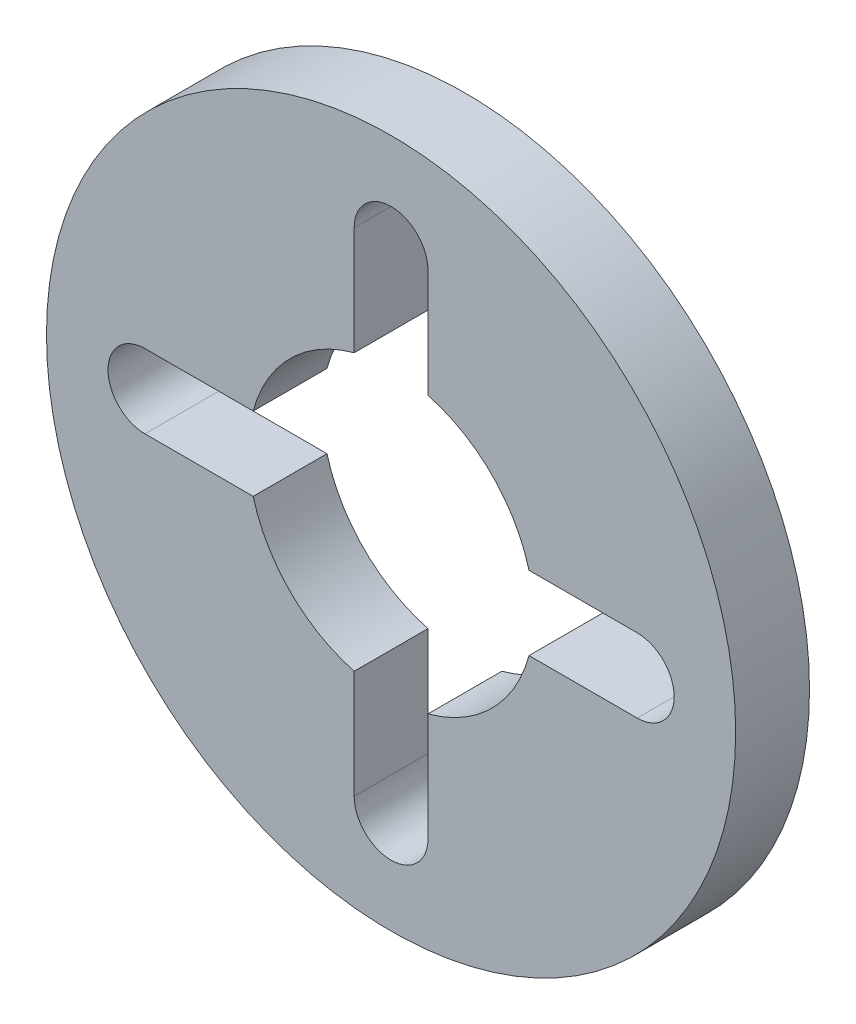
ISO-10303-21;
HEADER;
FILE_DESCRIPTION(('STEP AP214'),'2;1');
FILE_NAME('part.step','',(''),(''),'','','');
FILE_SCHEMA(('AUTOMOTIVE_DESIGN { 1 0 10303 214 1 1 1 1 }'));
ENDSEC;
DATA;
#1=APPLICATION_CONTEXT('core data for automotive mechanical design processes');
#2=APPLICATION_PROTOCOL_DEFINITION('international standard','automotive_design',2000,#1);
#3=PRODUCT_CONTEXT('',#1,'mechanical');
#4=PRODUCT('Part','Part','',(#3));
#5=PRODUCT_RELATED_PRODUCT_CATEGORY('part','',(#4));
#6=PRODUCT_DEFINITION_FORMATION('','',#4);
#7=PRODUCT_DEFINITION_CONTEXT('part definition',#1,'design');
#8=PRODUCT_DEFINITION('design','',#6,#7);
#9=PRODUCT_DEFINITION_SHAPE('','',#8);
#10=(LENGTH_UNIT() NAMED_UNIT(*) SI_UNIT(.MILLI.,.METRE.));
#11=(NAMED_UNIT(*) PLANE_ANGLE_UNIT() SI_UNIT($,.RADIAN.));
#12=(NAMED_UNIT(*) SI_UNIT($,.STERADIAN.) SOLID_ANGLE_UNIT());
#13=UNCERTAINTY_MEASURE_WITH_UNIT(LENGTH_MEASURE(1.E-05),#10,'distance_accuracy_value','');
#14=(GEOMETRIC_REPRESENTATION_CONTEXT(3) GLOBAL_UNCERTAINTY_ASSIGNED_CONTEXT((#13)) GLOBAL_UNIT_ASSIGNED_CONTEXT((#10,
#11,#12)) REPRESENTATION_CONTEXT('',''));
#15=CARTESIAN_POINT('',(0.,0.,0.));
#16=DIRECTION('',(0.,0.,1.));
#17=DIRECTION('',(1.,0.,0.));
#18=AXIS2_PLACEMENT_3D('',#15,#16,#17);
#19=CARTESIAN_POINT('',(0.,0.,1.5));
#20=DIRECTION('',(0.,0.,1.));
#21=DIRECTION('',(1.,0.,0.));
#22=AXIS2_PLACEMENT_3D('',#19,#20,#21);
#23=PLANE('',#22);
#24=CARTESIAN_POINT('',(0.,0.,1.5));
#25=DIRECTION('',(0.,0.,1.));
#26=DIRECTION('',(1.,0.,0.));
#27=AXIS2_PLACEMENT_3D('',#24,#25,#26);
#28=CIRCLE('',#27,7.);
#29=CARTESIAN_POINT('',(7.,0.,1.5));
#30=VERTEX_POINT('',#29);
#31=EDGE_CURVE('E11',#30,#30,#28,.T.);
#32=ORIENTED_EDGE('',*,*,#31,.T.);
#33=EDGE_LOOP('',(#32));
#34=FACE_BOUND('',#33,.T.);
#35=DIRECTION('',(0.,1.,0.));
#36=VECTOR('',#35,1.);
#37=CARTESIAN_POINT('',(0.75,5.,1.5));
#38=LINE('',#37,#36);
#39=CARTESIAN_POINT('',(0.750000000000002,2.80133896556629,1.5));
#40=VERTEX_POINT('',#39);
#41=CARTESIAN_POINT('',(0.750000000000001,5.,1.5));
#42=VERTEX_POINT('',#41);
#43=EDGE_CURVE('E157',#40,#42,#38,.T.);
#44=ORIENTED_EDGE('',*,*,#43,.F.);
#45=CARTESIAN_POINT('',(0.,0.,1.5));
#46=DIRECTION('',(0.,0.,1.));
#47=DIRECTION('',(1.,0.,0.));
#48=AXIS2_PLACEMENT_3D('',#45,#46,#47);
#49=CIRCLE('',#48,2.9);
#50=CARTESIAN_POINT('',(2.80133896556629,0.75,1.5));
#51=VERTEX_POINT('',#50);
#52=EDGE_CURVE('E149',#51,#40,#49,.T.);
#53=ORIENTED_EDGE('',*,*,#52,.F.);
#54=DIRECTION('',(-1.,0.,0.));
#55=VECTOR('',#54,1.);
#56=CARTESIAN_POINT('',(2.80133896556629,0.75,1.5));
#57=LINE('',#56,#55);
#58=CARTESIAN_POINT('',(5.,0.75,1.5));
#59=VERTEX_POINT('',#58);
#60=EDGE_CURVE('E197',#59,#51,#57,.T.);
#61=ORIENTED_EDGE('',*,*,#60,.F.);
#62=CARTESIAN_POINT('',(5.,0.,1.5));
#63=DIRECTION('',(0.,0.,1.));
#64=DIRECTION('',(1.,0.,0.));
#65=AXIS2_PLACEMENT_3D('',#62,#63,#64);
#66=CIRCLE('',#65,0.75);
#67=CARTESIAN_POINT('',(5.,-0.75,1.5));
#68=VERTEX_POINT('',#67);
#69=EDGE_CURVE('E195',#68,#59,#66,.T.);
#70=ORIENTED_EDGE('',*,*,#69,.F.);
#71=DIRECTION('',(1.,0.,0.));
#72=VECTOR('',#71,1.);
#73=CARTESIAN_POINT('',(2.80133896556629,-0.75,1.5));
#74=LINE('',#73,#72);
#75=CARTESIAN_POINT('',(2.80133896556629,-0.75,1.5));
#76=VERTEX_POINT('',#75);
#77=EDGE_CURVE('E193',#76,#68,#74,.T.);
#78=ORIENTED_EDGE('',*,*,#77,.F.);
#79=CARTESIAN_POINT('',(0.,0.,1.5));
#80=DIRECTION('',(0.,0.,1.));
#81=DIRECTION('',(1.,0.,0.));
#82=AXIS2_PLACEMENT_3D('',#79,#80,#81);
#83=CIRCLE('',#82,2.9);
#84=CARTESIAN_POINT('',(0.75,-2.80133896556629,1.5));
#85=VERTEX_POINT('',#84);
#86=EDGE_CURVE('E191',#85,#76,#83,.T.);
#87=ORIENTED_EDGE('',*,*,#86,.F.);
#88=DIRECTION('',(0.,1.,0.));
#89=VECTOR('',#88,1.);
#90=CARTESIAN_POINT('',(0.750000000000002,-2.80133896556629,1.5));
#91=LINE('',#90,#89);
#92=CARTESIAN_POINT('',(0.750000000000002,-5.,1.5));
#93=VERTEX_POINT('',#92);
#94=EDGE_CURVE('E189',#93,#85,#91,.T.);
#95=ORIENTED_EDGE('',*,*,#94,.F.);
#96=CARTESIAN_POINT('',(0.,-5.,1.5));
#97=DIRECTION('',(0.,0.,1.));
#98=DIRECTION('',(1.,0.,0.));
#99=AXIS2_PLACEMENT_3D('',#96,#97,#98);
#100=CIRCLE('',#99,0.75);
#101=CARTESIAN_POINT('',(-0.749999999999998,-5.,1.5));
#102=VERTEX_POINT('',#101);
#103=EDGE_CURVE('E187',#102,#93,#100,.T.);
#104=ORIENTED_EDGE('',*,*,#103,.F.);
#105=DIRECTION('',(0.,-1.,0.));
#106=VECTOR('',#105,1.);
#107=CARTESIAN_POINT('',(-0.749999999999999,-2.80133896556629,1.5));
#108=LINE('',#107,#106);
#109=CARTESIAN_POINT('',(-0.749999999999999,-2.80133896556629,1.5));
#110=VERTEX_POINT('',#109);
#111=EDGE_CURVE('E185',#110,#102,#108,.T.);
#112=ORIENTED_EDGE('',*,*,#111,.F.);
#113=CARTESIAN_POINT('',(0.,0.,1.5));
#114=DIRECTION('',(0.,0.,1.));
#115=DIRECTION('',(1.,0.,0.));
#116=AXIS2_PLACEMENT_3D('',#113,#114,#115);
#117=CIRCLE('',#116,2.9);
#118=CARTESIAN_POINT('',(-2.80133896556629,-0.75,1.5));
#119=VERTEX_POINT('',#118);
#120=EDGE_CURVE('E183',#119,#110,#117,.T.);
#121=ORIENTED_EDGE('',*,*,#120,.F.);
#122=DIRECTION('',(1.,0.,0.));
#123=VECTOR('',#122,1.);
#124=CARTESIAN_POINT('',(-5.,-0.75,1.5));
#125=LINE('',#124,#123);
#126=CARTESIAN_POINT('',(-5.,-0.75,1.5));
#127=VERTEX_POINT('',#126);
#128=EDGE_CURVE('E181',#127,#119,#125,.T.);
#129=ORIENTED_EDGE('',*,*,#128,.F.);
#130=CARTESIAN_POINT('',(-5.,0.,1.5));
#131=DIRECTION('',(0.,0.,1.));
#132=DIRECTION('',(1.,0.,0.));
#133=AXIS2_PLACEMENT_3D('',#130,#131,#132);
#134=CIRCLE('',#133,0.75);
#135=CARTESIAN_POINT('',(-5.,0.75,1.5));
#136=VERTEX_POINT('',#135);
#137=EDGE_CURVE('E179',#136,#127,#134,.T.);
#138=ORIENTED_EDGE('',*,*,#137,.F.);
#139=DIRECTION('',(-1.,0.,0.));
#140=VECTOR('',#139,1.);
#141=CARTESIAN_POINT('',(-5.,0.75,1.5));
#142=LINE('',#141,#140);
#143=CARTESIAN_POINT('',(-2.80133896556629,0.75,1.5));
#144=VERTEX_POINT('',#143);
#145=EDGE_CURVE('E177',#144,#136,#142,.T.);
#146=ORIENTED_EDGE('',*,*,#145,.F.);
#147=CARTESIAN_POINT('',(0.,0.,1.5));
#148=DIRECTION('',(0.,0.,1.));
#149=DIRECTION('',(1.,0.,0.));
#150=AXIS2_PLACEMENT_3D('',#147,#148,#149);
#151=CIRCLE('',#150,2.9);
#152=CARTESIAN_POINT('',(-0.749999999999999,2.80133896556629,1.5));
#153=VERTEX_POINT('',#152);
#154=EDGE_CURVE('E175',#153,#144,#151,.T.);
#155=ORIENTED_EDGE('',*,*,#154,.F.);
#156=DIRECTION('',(0.,-1.,0.));
#157=VECTOR('',#156,1.);
#158=CARTESIAN_POINT('',(-0.749999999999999,5.,1.5));
#159=LINE('',#158,#157);
#160=CARTESIAN_POINT('',(-0.749999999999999,5.,1.5));
#161=VERTEX_POINT('',#160);
#162=EDGE_CURVE('E171',#161,#153,#159,.T.);
#163=ORIENTED_EDGE('',*,*,#162,.F.);
#164=CARTESIAN_POINT('',(0.,5.,1.5));
#165=DIRECTION('',(0.,0.,1.));
#166=DIRECTION('',(1.,0.,0.));
#167=AXIS2_PLACEMENT_3D('',#164,#165,#166);
#168=CIRCLE('',#167,0.75);
#169=EDGE_CURVE('E169',#42,#161,#168,.T.);
#170=ORIENTED_EDGE('',*,*,#169,.F.);
#171=EDGE_LOOP('',(#44,#53,#61,#70,#78,#87,#95,#104,#112,#121,#129,#138,#146,#155,#163,#170));
#172=FACE_BOUND('',#171,.T.);
#173=ADVANCED_FACE('F36',(#34,#172),#23,.T.);
#174=CARTESIAN_POINT('',(0.,0.,0.));
#175=DIRECTION('',(0.,0.,1.));
#176=DIRECTION('',(1.,0.,0.));
#177=AXIS2_PLACEMENT_3D('',#174,#175,#176);
#178=PLANE('',#177);
#179=CARTESIAN_POINT('',(0.,0.,0.));
#180=DIRECTION('',(0.,0.,1.));
#181=DIRECTION('',(1.,0.,0.));
#182=AXIS2_PLACEMENT_3D('',#179,#180,#181);
#183=CIRCLE('',#182,7.);
#184=CARTESIAN_POINT('',(7.,0.,0.));
#185=VERTEX_POINT('',#184);
#186=EDGE_CURVE('E40',#185,#185,#183,.T.);
#187=ORIENTED_EDGE('',*,*,#186,.F.);
#188=EDGE_LOOP('',(#187));
#189=FACE_BOUND('',#188,.T.);
#190=CARTESIAN_POINT('',(0.,0.,0.));
#191=DIRECTION('',(0.,0.,1.));
#192=DIRECTION('',(1.,0.,0.));
#193=AXIS2_PLACEMENT_3D('',#190,#191,#192);
#194=CIRCLE('',#193,2.9);
#195=CARTESIAN_POINT('',(2.80133896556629,0.75,0.));
#196=VERTEX_POINT('',#195);
#197=CARTESIAN_POINT('',(0.750000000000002,2.80133896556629,0.));
#198=VERTEX_POINT('',#197);
#199=EDGE_CURVE('E59',#196,#198,#194,.T.);
#200=ORIENTED_EDGE('',*,*,#199,.T.);
#201=DIRECTION('',(0.,1.,0.));
#202=VECTOR('',#201,1.);
#203=CARTESIAN_POINT('',(0.75,5.,0.));
#204=LINE('',#203,#202);
#205=CARTESIAN_POINT('',(0.750000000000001,5.,0.));
#206=VERTEX_POINT('',#205);
#207=EDGE_CURVE('E164',#198,#206,#204,.T.);
#208=ORIENTED_EDGE('',*,*,#207,.T.);
#209=CARTESIAN_POINT('',(0.,5.,0.));
#210=DIRECTION('',(0.,0.,1.));
#211=DIRECTION('',(1.,0.,0.));
#212=AXIS2_PLACEMENT_3D('',#209,#210,#211);
#213=CIRCLE('',#212,0.75);
#214=CARTESIAN_POINT('',(-0.749999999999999,5.,0.));
#215=VERTEX_POINT('',#214);
#216=EDGE_CURVE('E201',#206,#215,#213,.T.);
#217=ORIENTED_EDGE('',*,*,#216,.T.);
#218=DIRECTION('',(0.,-1.,0.));
#219=VECTOR('',#218,1.);
#220=CARTESIAN_POINT('',(-0.749999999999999,5.,0.));
#221=LINE('',#220,#219);
#222=CARTESIAN_POINT('',(-0.749999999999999,2.80133896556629,0.));
#223=VERTEX_POINT('',#222);
#224=EDGE_CURVE('E204',#215,#223,#221,.T.);
#225=ORIENTED_EDGE('',*,*,#224,.T.);
#226=CARTESIAN_POINT('',(0.,0.,0.));
#227=DIRECTION('',(0.,0.,1.));
#228=DIRECTION('',(1.,0.,0.));
#229=AXIS2_PLACEMENT_3D('',#226,#227,#228);
#230=CIRCLE('',#229,2.9);
#231=CARTESIAN_POINT('',(-2.80133896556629,0.75,0.));
#232=VERTEX_POINT('',#231);
#233=EDGE_CURVE('E207',#223,#232,#230,.T.);
#234=ORIENTED_EDGE('',*,*,#233,.T.);
#235=DIRECTION('',(-1.,0.,0.));
#236=VECTOR('',#235,1.);
#237=CARTESIAN_POINT('',(-5.,0.75,0.));
#238=LINE('',#237,#236);
#239=CARTESIAN_POINT('',(-5.,0.75,0.));
#240=VERTEX_POINT('',#239);
#241=EDGE_CURVE('E210',#232,#240,#238,.T.);
#242=ORIENTED_EDGE('',*,*,#241,.T.);
#243=CARTESIAN_POINT('',(-5.,0.,0.));
#244=DIRECTION('',(0.,0.,1.));
#245=DIRECTION('',(1.,0.,0.));
#246=AXIS2_PLACEMENT_3D('',#243,#244,#245);
#247=CIRCLE('',#246,0.75);
#248=CARTESIAN_POINT('',(-5.,-0.75,0.));
#249=VERTEX_POINT('',#248);
#250=EDGE_CURVE('E213',#240,#249,#247,.T.);
#251=ORIENTED_EDGE('',*,*,#250,.T.);
#252=DIRECTION('',(1.,0.,0.));
#253=VECTOR('',#252,1.);
#254=CARTESIAN_POINT('',(-5.,-0.75,0.));
#255=LINE('',#254,#253);
#256=CARTESIAN_POINT('',(-2.80133896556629,-0.75,0.));
#257=VERTEX_POINT('',#256);
#258=EDGE_CURVE('E216',#249,#257,#255,.T.);
#259=ORIENTED_EDGE('',*,*,#258,.T.);
#260=CARTESIAN_POINT('',(0.,0.,0.));
#261=DIRECTION('',(0.,0.,1.));
#262=DIRECTION('',(1.,0.,0.));
#263=AXIS2_PLACEMENT_3D('',#260,#261,#262);
#264=CIRCLE('',#263,2.9);
#265=CARTESIAN_POINT('',(-0.749999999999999,-2.80133896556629,0.));
#266=VERTEX_POINT('',#265);
#267=EDGE_CURVE('E219',#257,#266,#264,.T.);
#268=ORIENTED_EDGE('',*,*,#267,.T.);
#269=DIRECTION('',(0.,-1.,0.));
#270=VECTOR('',#269,1.);
#271=CARTESIAN_POINT('',(-0.749999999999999,-2.80133896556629,0.));
#272=LINE('',#271,#270);
#273=CARTESIAN_POINT('',(-0.749999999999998,-5.,0.));
#274=VERTEX_POINT('',#273);
#275=EDGE_CURVE('E222',#266,#274,#272,.T.);
#276=ORIENTED_EDGE('',*,*,#275,.T.);
#277=CARTESIAN_POINT('',(0.,-5.,0.));
#278=DIRECTION('',(0.,0.,1.));
#279=DIRECTION('',(1.,0.,0.));
#280=AXIS2_PLACEMENT_3D('',#277,#278,#279);
#281=CIRCLE('',#280,0.75);
#282=CARTESIAN_POINT('',(0.750000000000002,-5.,0.));
#283=VERTEX_POINT('',#282);
#284=EDGE_CURVE('E225',#274,#283,#281,.T.);
#285=ORIENTED_EDGE('',*,*,#284,.T.);
#286=DIRECTION('',(0.,1.,0.));
#287=VECTOR('',#286,1.);
#288=CARTESIAN_POINT('',(0.750000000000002,-2.80133896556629,0.));
#289=LINE('',#288,#287);
#290=CARTESIAN_POINT('',(0.75,-2.80133896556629,0.));
#291=VERTEX_POINT('',#290);
#292=EDGE_CURVE('E228',#283,#291,#289,.T.);
#293=ORIENTED_EDGE('',*,*,#292,.T.);
#294=CARTESIAN_POINT('',(0.,0.,0.));
#295=DIRECTION('',(0.,0.,1.));
#296=DIRECTION('',(1.,0.,0.));
#297=AXIS2_PLACEMENT_3D('',#294,#295,#296);
#298=CIRCLE('',#297,2.9);
#299=CARTESIAN_POINT('',(2.80133896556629,-0.75,0.));
#300=VERTEX_POINT('',#299);
#301=EDGE_CURVE('E231',#291,#300,#298,.T.);
#302=ORIENTED_EDGE('',*,*,#301,.T.);
#303=DIRECTION('',(1.,0.,0.));
#304=VECTOR('',#303,1.);
#305=CARTESIAN_POINT('',(2.80133896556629,-0.75,0.));
#306=LINE('',#305,#304);
#307=CARTESIAN_POINT('',(5.,-0.75,0.));
#308=VERTEX_POINT('',#307);
#309=EDGE_CURVE('E234',#300,#308,#306,.T.);
#310=ORIENTED_EDGE('',*,*,#309,.T.);
#311=CARTESIAN_POINT('',(5.,0.,0.));
#312=DIRECTION('',(0.,0.,1.));
#313=DIRECTION('',(1.,0.,0.));
#314=AXIS2_PLACEMENT_3D('',#311,#312,#313);
#315=CIRCLE('',#314,0.75);
#316=CARTESIAN_POINT('',(5.,0.75,0.));
#317=VERTEX_POINT('',#316);
#318=EDGE_CURVE('E237',#308,#317,#315,.T.);
#319=ORIENTED_EDGE('',*,*,#318,.T.);
#320=DIRECTION('',(-1.,0.,0.));
#321=VECTOR('',#320,1.);
#322=CARTESIAN_POINT('',(2.80133896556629,0.75,0.));
#323=LINE('',#322,#321);
#324=EDGE_CURVE('E158',#317,#196,#323,.T.);
#325=ORIENTED_EDGE('',*,*,#324,.T.);
#326=EDGE_LOOP('',(#200,#208,#217,#225,#234,#242,#251,#259,#268,#276,#285,#293,#302,#310,#319,#325));
#327=FACE_BOUND('',#326,.T.);
#328=ADVANCED_FACE('F274',(#189,#327),#178,.F.);
#329=CARTESIAN_POINT('',(0.,0.,1.5));
#330=DIRECTION('',(0.,0.,-1.));
#331=DIRECTION('',(-1.,0.,0.));
#332=AXIS2_PLACEMENT_3D('',#329,#330,#331);
#333=CYLINDRICAL_SURFACE('',#332,7.);
#334=ORIENTED_EDGE('',*,*,#31,.F.);
#335=EDGE_LOOP('',(#334));
#336=FACE_BOUND('',#335,.T.);
#337=ORIENTED_EDGE('',*,*,#186,.T.);
#338=EDGE_LOOP('',(#337));
#339=FACE_BOUND('',#338,.T.);
#340=ADVANCED_FACE('F38',(#336,#339),#333,.T.);
#341=CARTESIAN_POINT('',(0.,0.,1.5));
#342=DIRECTION('',(0.,0.,-1.));
#343=DIRECTION('',(-1.,0.,0.));
#344=AXIS2_PLACEMENT_3D('',#341,#342,#343);
#345=CYLINDRICAL_SURFACE('',#344,2.9);
#346=ORIENTED_EDGE('',*,*,#199,.F.);
#347=DIRECTION('',(0.,0.,-1.));
#348=VECTOR('',#347,1.);
#349=CARTESIAN_POINT('',(2.80133896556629,0.75,1.5));
#350=LINE('',#349,#348);
#351=EDGE_CURVE('E153',#51,#196,#350,.T.);
#352=ORIENTED_EDGE('',*,*,#351,.F.);
#353=ORIENTED_EDGE('',*,*,#52,.T.);
#354=DIRECTION('',(0.,0.,-1.));
#355=VECTOR('',#354,1.);
#356=CARTESIAN_POINT('',(0.750000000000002,2.80133896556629,1.5));
#357=LINE('',#356,#355);
#358=EDGE_CURVE('E152',#40,#198,#357,.T.);
#359=ORIENTED_EDGE('',*,*,#358,.T.);
#360=EDGE_LOOP('',(#346,#352,#353,#359));
#361=FACE_BOUND('',#360,.T.);
#362=ADVANCED_FACE('F151',(#361),#345,.F.);
#363=CARTESIAN_POINT('',(0.75,5.,1.5));
#364=DIRECTION('',(-1.,0.,0.));
#365=DIRECTION('',(0.,-1.,0.));
#366=AXIS2_PLACEMENT_3D('',#363,#364,#365);
#367=PLANE('',#366);
#368=ORIENTED_EDGE('',*,*,#207,.F.);
#369=ORIENTED_EDGE('',*,*,#358,.F.);
#370=ORIENTED_EDGE('',*,*,#43,.T.);
#371=DIRECTION('',(0.,0.,-1.));
#372=VECTOR('',#371,1.);
#373=CARTESIAN_POINT('',(0.750000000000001,5.,1.5));
#374=LINE('',#373,#372);
#375=EDGE_CURVE('E165',#42,#206,#374,.T.);
#376=ORIENTED_EDGE('',*,*,#375,.T.);
#377=EDGE_LOOP('',(#368,#369,#370,#376));
#378=FACE_BOUND('',#377,.T.);
#379=ADVANCED_FACE('F161',(#378),#367,.T.);
#380=CARTESIAN_POINT('',(0.,5.,1.5));
#381=DIRECTION('',(0.,0.,-1.));
#382=DIRECTION('',(-1.,0.,0.));
#383=AXIS2_PLACEMENT_3D('',#380,#381,#382);
#384=CYLINDRICAL_SURFACE('',#383,0.75);
#385=ORIENTED_EDGE('',*,*,#216,.F.);
#386=ORIENTED_EDGE('',*,*,#375,.F.);
#387=ORIENTED_EDGE('',*,*,#169,.T.);
#388=DIRECTION('',(0.,0.,-1.));
#389=VECTOR('',#388,1.);
#390=CARTESIAN_POINT('',(-0.749999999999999,5.,1.5));
#391=LINE('',#390,#389);
#392=EDGE_CURVE('E266',#161,#215,#391,.T.);
#393=ORIENTED_EDGE('',*,*,#392,.T.);
#394=EDGE_LOOP('',(#385,#386,#387,#393));
#395=FACE_BOUND('',#394,.T.);
#396=ADVANCED_FACE('F270',(#395),#384,.F.);
#397=CARTESIAN_POINT('',(-0.749999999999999,5.,1.5));
#398=DIRECTION('',(1.,0.,0.));
#399=DIRECTION('',(0.,1.,0.));
#400=AXIS2_PLACEMENT_3D('',#397,#398,#399);
#401=PLANE('',#400);
#402=ORIENTED_EDGE('',*,*,#224,.F.);
#403=ORIENTED_EDGE('',*,*,#392,.F.);
#404=ORIENTED_EDGE('',*,*,#162,.T.);
#405=DIRECTION('',(0.,0.,-1.));
#406=VECTOR('',#405,1.);
#407=CARTESIAN_POINT('',(-0.749999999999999,2.80133896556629,1.5));
#408=LINE('',#407,#406);
#409=EDGE_CURVE('E264',#153,#223,#408,.T.);
#410=ORIENTED_EDGE('',*,*,#409,.T.);
#411=EDGE_LOOP('',(#402,#403,#404,#410));
#412=FACE_BOUND('',#411,.T.);
#413=ADVANCED_FACE('F332',(#412),#401,.T.);
#414=CARTESIAN_POINT('',(0.,0.,1.5));
#415=DIRECTION('',(0.,0.,-1.));
#416=DIRECTION('',(-1.,0.,0.));
#417=AXIS2_PLACEMENT_3D('',#414,#415,#416);
#418=CYLINDRICAL_SURFACE('',#417,2.9);
#419=ORIENTED_EDGE('',*,*,#233,.F.);
#420=ORIENTED_EDGE('',*,*,#409,.F.);
#421=ORIENTED_EDGE('',*,*,#154,.T.);
#422=DIRECTION('',(0.,0.,-1.));
#423=VECTOR('',#422,1.);
#424=CARTESIAN_POINT('',(-2.80133896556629,0.75,1.5));
#425=LINE('',#424,#423);
#426=EDGE_CURVE('E262',#144,#232,#425,.T.);
#427=ORIENTED_EDGE('',*,*,#426,.T.);
#428=EDGE_LOOP('',(#419,#420,#421,#427));
#429=FACE_BOUND('',#428,.T.);
#430=ADVANCED_FACE('F329',(#429),#418,.F.);
#431=CARTESIAN_POINT('',(-5.,0.75,1.5));
#432=DIRECTION('',(0.,-1.,0.));
#433=DIRECTION('',(1.,0.,0.));
#434=AXIS2_PLACEMENT_3D('',#431,#432,#433);
#435=PLANE('',#434);
#436=ORIENTED_EDGE('',*,*,#241,.F.);
#437=ORIENTED_EDGE('',*,*,#426,.F.);
#438=ORIENTED_EDGE('',*,*,#145,.T.);
#439=DIRECTION('',(0.,0.,-1.));
#440=VECTOR('',#439,1.);
#441=CARTESIAN_POINT('',(-5.,0.75,1.5));
#442=LINE('',#441,#440);
#443=EDGE_CURVE('E260',#136,#240,#442,.T.);
#444=ORIENTED_EDGE('',*,*,#443,.T.);
#445=EDGE_LOOP('',(#436,#437,#438,#444));
#446=FACE_BOUND('',#445,.T.);
#447=ADVANCED_FACE('F326',(#446),#435,.T.);
#448=CARTESIAN_POINT('',(-5.,0.,1.5));
#449=DIRECTION('',(0.,0.,-1.));
#450=DIRECTION('',(-1.,0.,0.));
#451=AXIS2_PLACEMENT_3D('',#448,#449,#450);
#452=CYLINDRICAL_SURFACE('',#451,0.75);
#453=ORIENTED_EDGE('',*,*,#250,.F.);
#454=ORIENTED_EDGE('',*,*,#443,.F.);
#455=ORIENTED_EDGE('',*,*,#137,.T.);
#456=DIRECTION('',(0.,0.,-1.));
#457=VECTOR('',#456,1.);
#458=CARTESIAN_POINT('',(-5.,-0.75,1.5));
#459=LINE('',#458,#457);
#460=EDGE_CURVE('E258',#127,#249,#459,.T.);
#461=ORIENTED_EDGE('',*,*,#460,.T.);
#462=EDGE_LOOP('',(#453,#454,#455,#461));
#463=FACE_BOUND('',#462,.T.);
#464=ADVANCED_FACE('F319',(#463),#452,.F.);
#465=CARTESIAN_POINT('',(-5.,-0.75,1.5));
#466=DIRECTION('',(0.,1.,0.));
#467=DIRECTION('',(0.,0.,1.));
#468=AXIS2_PLACEMENT_3D('',#465,#466,#467);
#469=PLANE('',#468);
#470=ORIENTED_EDGE('',*,*,#258,.F.);
#471=ORIENTED_EDGE('',*,*,#460,.F.);
#472=ORIENTED_EDGE('',*,*,#128,.T.);
#473=DIRECTION('',(0.,0.,-1.));
#474=VECTOR('',#473,1.);
#475=CARTESIAN_POINT('',(-2.80133896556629,-0.75,1.5));
#476=LINE('',#475,#474);
#477=EDGE_CURVE('E256',#119,#257,#476,.T.);
#478=ORIENTED_EDGE('',*,*,#477,.T.);
#479=EDGE_LOOP('',(#470,#471,#472,#478));
#480=FACE_BOUND('',#479,.T.);
#481=ADVANCED_FACE('F315',(#480),#469,.T.);
#482=CARTESIAN_POINT('',(0.,0.,1.5));
#483=DIRECTION('',(0.,0.,-1.));
#484=DIRECTION('',(-1.,0.,0.));
#485=AXIS2_PLACEMENT_3D('',#482,#483,#484);
#486=CYLINDRICAL_SURFACE('',#485,2.9);
#487=ORIENTED_EDGE('',*,*,#267,.F.);
#488=ORIENTED_EDGE('',*,*,#477,.F.);
#489=ORIENTED_EDGE('',*,*,#120,.T.);
#490=DIRECTION('',(0.,0.,-1.));
#491=VECTOR('',#490,1.);
#492=CARTESIAN_POINT('',(-0.749999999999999,-2.80133896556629,1.5));
#493=LINE('',#492,#491);
#494=EDGE_CURVE('E254',#110,#266,#493,.T.);
#495=ORIENTED_EDGE('',*,*,#494,.T.);
#496=EDGE_LOOP('',(#487,#488,#489,#495));
#497=FACE_BOUND('',#496,.T.);
#498=ADVANCED_FACE('F312',(#497),#486,.F.);
#499=CARTESIAN_POINT('',(-0.749999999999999,-2.80133896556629,1.5));
#500=DIRECTION('',(1.,0.,0.));
#501=DIRECTION('',(0.,0.,-1.));
#502=AXIS2_PLACEMENT_3D('',#499,#500,#501);
#503=PLANE('',#502);
#504=ORIENTED_EDGE('',*,*,#275,.F.);
#505=ORIENTED_EDGE('',*,*,#494,.F.);
#506=ORIENTED_EDGE('',*,*,#111,.T.);
#507=DIRECTION('',(0.,0.,-1.));
#508=VECTOR('',#507,1.);
#509=CARTESIAN_POINT('',(-0.749999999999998,-5.,1.5));
#510=LINE('',#509,#508);
#511=EDGE_CURVE('E252',#102,#274,#510,.T.);
#512=ORIENTED_EDGE('',*,*,#511,.T.);
#513=EDGE_LOOP('',(#504,#505,#506,#512));
#514=FACE_BOUND('',#513,.T.);
#515=ADVANCED_FACE('F304',(#514),#503,.T.);
#516=CARTESIAN_POINT('',(0.,-5.,1.5));
#517=DIRECTION('',(0.,0.,-1.));
#518=DIRECTION('',(-1.,0.,0.));
#519=AXIS2_PLACEMENT_3D('',#516,#517,#518);
#520=CYLINDRICAL_SURFACE('',#519,0.75);
#521=ORIENTED_EDGE('',*,*,#284,.F.);
#522=ORIENTED_EDGE('',*,*,#511,.F.);
#523=ORIENTED_EDGE('',*,*,#103,.T.);
#524=DIRECTION('',(0.,0.,-1.));
#525=VECTOR('',#524,1.);
#526=CARTESIAN_POINT('',(0.750000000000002,-5.,1.5));
#527=LINE('',#526,#525);
#528=EDGE_CURVE('E250',#93,#283,#527,.T.);
#529=ORIENTED_EDGE('',*,*,#528,.T.);
#530=EDGE_LOOP('',(#521,#522,#523,#529));
#531=FACE_BOUND('',#530,.T.);
#532=ADVANCED_FACE('F300',(#531),#520,.F.);
#533=CARTESIAN_POINT('',(0.750000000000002,-2.80133896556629,1.5));
#534=DIRECTION('',(-1.,0.,0.));
#535=DIRECTION('',(0.,-1.,0.));
#536=AXIS2_PLACEMENT_3D('',#533,#534,#535);
#537=PLANE('',#536);
#538=ORIENTED_EDGE('',*,*,#292,.F.);
#539=ORIENTED_EDGE('',*,*,#528,.F.);
#540=ORIENTED_EDGE('',*,*,#94,.T.);
#541=DIRECTION('',(0.,0.,-1.));
#542=VECTOR('',#541,1.);
#543=CARTESIAN_POINT('',(0.75,-2.80133896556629,1.5));
#544=LINE('',#543,#542);
#545=EDGE_CURVE('E248',#85,#291,#544,.T.);
#546=ORIENTED_EDGE('',*,*,#545,.T.);
#547=EDGE_LOOP('',(#538,#539,#540,#546));
#548=FACE_BOUND('',#547,.T.);
#549=ADVANCED_FACE('F297',(#548),#537,.T.);
#550=CARTESIAN_POINT('',(0.,0.,1.5));
#551=DIRECTION('',(0.,0.,-1.));
#552=DIRECTION('',(-1.,0.,0.));
#553=AXIS2_PLACEMENT_3D('',#550,#551,#552);
#554=CYLINDRICAL_SURFACE('',#553,2.9);
#555=ORIENTED_EDGE('',*,*,#301,.F.);
#556=ORIENTED_EDGE('',*,*,#545,.F.);
#557=ORIENTED_EDGE('',*,*,#86,.T.);
#558=DIRECTION('',(0.,0.,-1.));
#559=VECTOR('',#558,1.);
#560=CARTESIAN_POINT('',(2.80133896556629,-0.75,1.5));
#561=LINE('',#560,#559);
#562=EDGE_CURVE('E246',#76,#300,#561,.T.);
#563=ORIENTED_EDGE('',*,*,#562,.T.);
#564=EDGE_LOOP('',(#555,#556,#557,#563));
#565=FACE_BOUND('',#564,.T.);
#566=ADVANCED_FACE('F289',(#565),#554,.F.);
#567=CARTESIAN_POINT('',(2.80133896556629,-0.75,1.5));
#568=DIRECTION('',(0.,1.,0.));
#569=DIRECTION('',(-1.,0.,0.));
#570=AXIS2_PLACEMENT_3D('',#567,#568,#569);
#571=PLANE('',#570);
#572=ORIENTED_EDGE('',*,*,#309,.F.);
#573=ORIENTED_EDGE('',*,*,#562,.F.);
#574=ORIENTED_EDGE('',*,*,#77,.T.);
#575=DIRECTION('',(0.,0.,-1.));
#576=VECTOR('',#575,1.);
#577=CARTESIAN_POINT('',(5.,-0.75,1.5));
#578=LINE('',#577,#576);
#579=EDGE_CURVE('E244',#68,#308,#578,.T.);
#580=ORIENTED_EDGE('',*,*,#579,.T.);
#581=EDGE_LOOP('',(#572,#573,#574,#580));
#582=FACE_BOUND('',#581,.T.);
#583=ADVANCED_FACE('F285',(#582),#571,.T.);
#584=CARTESIAN_POINT('',(5.,0.,1.5));
#585=DIRECTION('',(0.,0.,-1.));
#586=DIRECTION('',(-1.,0.,0.));
#587=AXIS2_PLACEMENT_3D('',#584,#585,#586);
#588=CYLINDRICAL_SURFACE('',#587,0.75);
#589=ORIENTED_EDGE('',*,*,#318,.F.);
#590=ORIENTED_EDGE('',*,*,#579,.F.);
#591=ORIENTED_EDGE('',*,*,#69,.T.);
#592=DIRECTION('',(0.,0.,-1.));
#593=VECTOR('',#592,1.);
#594=CARTESIAN_POINT('',(5.,0.75,1.5));
#595=LINE('',#594,#593);
#596=EDGE_CURVE('E51',#59,#317,#595,.T.);
#597=ORIENTED_EDGE('',*,*,#596,.T.);
#598=EDGE_LOOP('',(#589,#590,#591,#597));
#599=FACE_BOUND('',#598,.T.);
#600=ADVANCED_FACE('F282',(#599),#588,.F.);
#601=CARTESIAN_POINT('',(2.80133896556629,0.75,1.5));
#602=DIRECTION('',(0.,-1.,0.));
#603=DIRECTION('',(0.,0.,-1.));
#604=AXIS2_PLACEMENT_3D('',#601,#602,#603);
#605=PLANE('',#604);
#606=ORIENTED_EDGE('',*,*,#324,.F.);
#607=ORIENTED_EDGE('',*,*,#596,.F.);
#608=ORIENTED_EDGE('',*,*,#60,.T.);
#609=ORIENTED_EDGE('',*,*,#351,.T.);
#610=EDGE_LOOP('',(#606,#607,#608,#609));
#611=FACE_BOUND('',#610,.T.);
#612=ADVANCED_FACE('F276',(#611),#605,.T.);
#613=CLOSED_SHELL('',(#173,#328,#340,#362,#379,#396,#413,#430,#447,#464,#481,#498,#515,#532,
#549,#566,#583,#600,#612));
#614=MANIFOLD_SOLID_BREP('B2',#613);
#615=ADVANCED_BREP_SHAPE_REPRESENTATION('',(#18,#614),#14);
#616=SHAPE_DEFINITION_REPRESENTATION(#9,#615);
ENDSEC;
END-ISO-10303-21;
